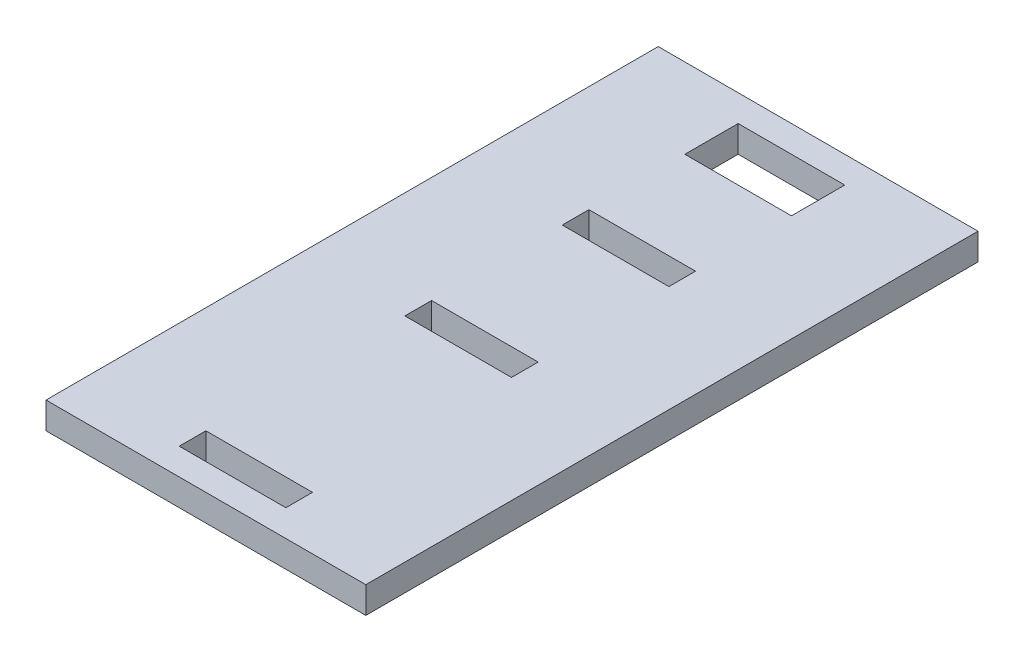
from build123d import *

# Parameters (mm, degrees)
SKETCH1_W           = 59.99988
SKETCH1_H           = 114.8613654
SKETCH1_W_2         = 20
SKETCH1_H_2         = 10
SKETCH1_H_3         = 5
BOSS_EXTRUDE1_DEPTH = 5


with BuildPart() as part:
    # Sketch1 → Boss-Extrude1 (new body)
    with BuildSketch(Plane(origin=(0, 0, 0), x_dir=(1, 0, 0), z_dir=(0, 1, 0))):
        with Locations((29.99994, 57.4306827)):
            Rectangle(SKETCH1_W, SKETCH1_H)
        with Locations((29.99994, 104.8613654)):
            Rectangle(SKETCH1_W_2, SKETCH1_H_2, mode=Mode.SUBTRACT)
        with Locations((29.99994, 7.5)):
            Rectangle(SKETCH1_W_2, SKETCH1_H_3, mode=Mode.SUBTRACT)
        with Locations((29.99994, 49.838)):
            Rectangle(SKETCH1_W_2, SKETCH1_H_3, mode=Mode.SUBTRACT)
        with Locations((29.99994, 79.36424)):
            Rectangle(SKETCH1_W_2, SKETCH1_H_3, mode=Mode.SUBTRACT)
    extrude(amount=BOSS_EXTRUDE1_DEPTH)


solid = part.part
